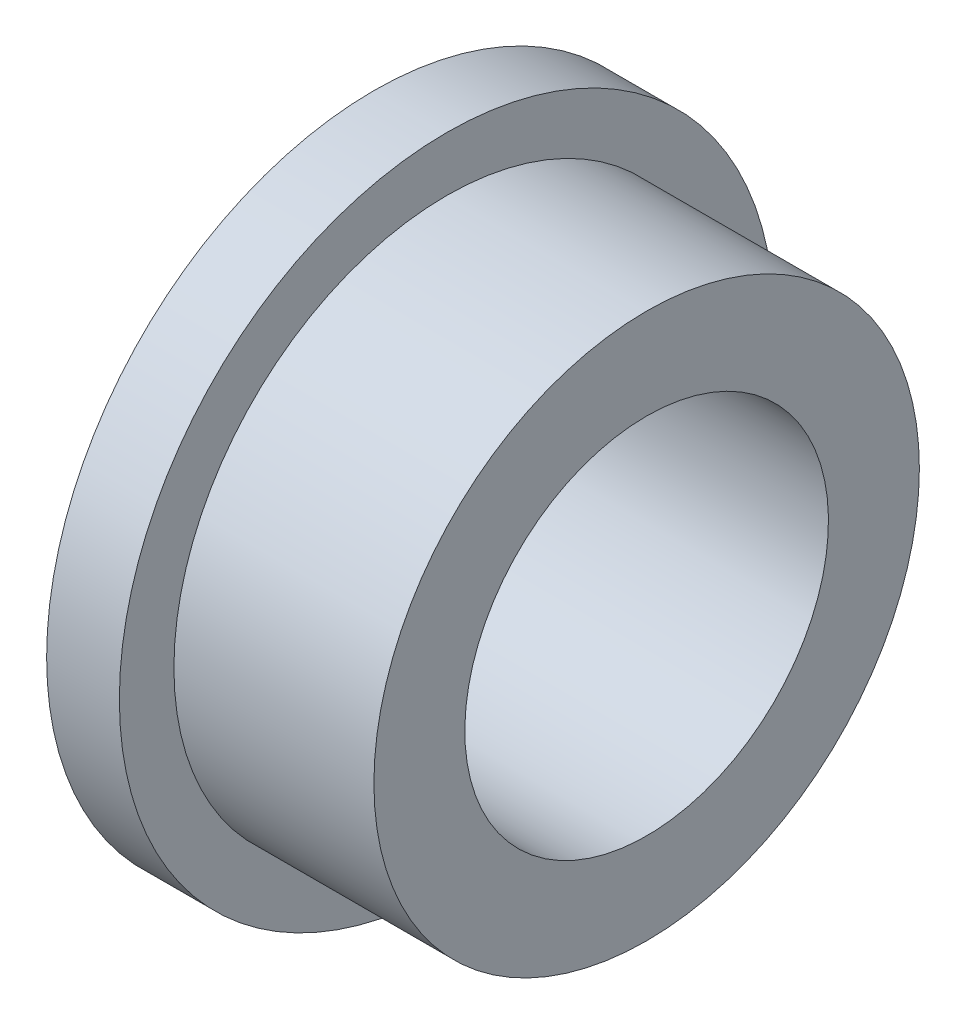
ISO-10303-21;
HEADER;
FILE_DESCRIPTION(('STEP AP214'),'2;1');
FILE_NAME('part.step','',(''),(''),'','','');
FILE_SCHEMA(('AUTOMOTIVE_DESIGN { 1 0 10303 214 1 1 1 1 }'));
ENDSEC;
DATA;
#1=APPLICATION_CONTEXT('core data for automotive mechanical design processes');
#2=APPLICATION_PROTOCOL_DEFINITION('international standard','automotive_design',2000,#1);
#3=PRODUCT_CONTEXT('',#1,'mechanical');
#4=PRODUCT('Part','Part','',(#3));
#5=PRODUCT_RELATED_PRODUCT_CATEGORY('part','',(#4));
#6=PRODUCT_DEFINITION_FORMATION('','',#4);
#7=PRODUCT_DEFINITION_CONTEXT('part definition',#1,'design');
#8=PRODUCT_DEFINITION('design','',#6,#7);
#9=PRODUCT_DEFINITION_SHAPE('','',#8);
#10=(LENGTH_UNIT() NAMED_UNIT(*) SI_UNIT(.MILLI.,.METRE.));
#11=(NAMED_UNIT(*) PLANE_ANGLE_UNIT() SI_UNIT($,.RADIAN.));
#12=(NAMED_UNIT(*) SI_UNIT($,.STERADIAN.) SOLID_ANGLE_UNIT());
#13=UNCERTAINTY_MEASURE_WITH_UNIT(LENGTH_MEASURE(1.E-05),#10,'distance_accuracy_value','');
#14=(GEOMETRIC_REPRESENTATION_CONTEXT(3) GLOBAL_UNCERTAINTY_ASSIGNED_CONTEXT((#13)) GLOBAL_UNIT_ASSIGNED_CONTEXT((#10,
#11,#12)) REPRESENTATION_CONTEXT('',''));
#15=CARTESIAN_POINT('',(0.,0.,0.));
#16=DIRECTION('',(0.,0.,1.));
#17=DIRECTION('',(1.,0.,0.));
#18=AXIS2_PLACEMENT_3D('',#15,#16,#17);
#19=CARTESIAN_POINT('',(0.,5.,0.));
#20=DIRECTION('',(1.,0.,0.));
#21=DIRECTION('',(0.,1.,0.));
#22=AXIS2_PLACEMENT_3D('',#19,#20,#21);
#23=PLANE('',#22);
#24=CARTESIAN_POINT('',(0.,0.,0.));
#25=DIRECTION('',(1.,0.,0.));
#26=DIRECTION('',(0.,1.,0.));
#27=AXIS2_PLACEMENT_3D('',#24,#25,#26);
#28=CIRCLE('',#27,7.5);
#29=CARTESIAN_POINT('',(0.,7.5,0.));
#30=VERTEX_POINT('',#29);
#31=EDGE_CURVE('E10',#30,#30,#28,.T.);
#32=ORIENTED_EDGE('',*,*,#31,.T.);
#33=EDGE_LOOP('',(#32));
#34=FACE_BOUND('',#33,.T.);
#35=CARTESIAN_POINT('',(0.,0.,0.));
#36=DIRECTION('',(1.,0.,0.));
#37=DIRECTION('',(0.,1.,0.));
#38=AXIS2_PLACEMENT_3D('',#35,#36,#37);
#39=CIRCLE('',#38,5.);
#40=CARTESIAN_POINT('',(0.,5.,0.));
#41=VERTEX_POINT('',#40);
#42=EDGE_CURVE('E370',#41,#41,#39,.T.);
#43=ORIENTED_EDGE('',*,*,#42,.F.);
#44=EDGE_LOOP('',(#43));
#45=FACE_BOUND('',#44,.T.);
#46=ADVANCED_FACE('F348',(#34,#45),#23,.T.);
#47=CARTESIAN_POINT('',(0.,0.,0.));
#48=DIRECTION('',(1.,0.,0.));
#49=DIRECTION('',(0.,1.,0.));
#50=AXIS2_PLACEMENT_3D('',#47,#48,#49);
#51=CYLINDRICAL_SURFACE('',#50,7.5);
#52=CARTESIAN_POINT('',(-5.5,0.,0.));
#53=DIRECTION('',(1.,0.,0.));
#54=DIRECTION('',(0.,1.,0.));
#55=AXIS2_PLACEMENT_3D('',#52,#53,#54);
#56=CIRCLE('',#55,7.5);
#57=CARTESIAN_POINT('',(-5.5,7.5,0.));
#58=VERTEX_POINT('',#57);
#59=EDGE_CURVE('E354',#58,#58,#56,.T.);
#60=ORIENTED_EDGE('',*,*,#59,.T.);
#61=EDGE_LOOP('',(#60));
#62=FACE_BOUND('',#61,.T.);
#63=ORIENTED_EDGE('',*,*,#31,.F.);
#64=EDGE_LOOP('',(#63));
#65=FACE_BOUND('',#64,.T.);
#66=ADVANCED_FACE('F378',(#62,#65),#51,.T.);
#67=CARTESIAN_POINT('',(-5.5,7.5,0.));
#68=DIRECTION('',(1.,0.,0.));
#69=DIRECTION('',(0.,1.,0.));
#70=AXIS2_PLACEMENT_3D('',#67,#68,#69);
#71=PLANE('',#70);
#72=CARTESIAN_POINT('',(-5.5,0.,0.));
#73=DIRECTION('',(1.,0.,0.));
#74=DIRECTION('',(0.,1.,0.));
#75=AXIS2_PLACEMENT_3D('',#72,#73,#74);
#76=CIRCLE('',#75,9.);
#77=CARTESIAN_POINT('',(-5.5,9.,0.));
#78=VERTEX_POINT('',#77);
#79=EDGE_CURVE('E358',#78,#78,#76,.T.);
#80=ORIENTED_EDGE('',*,*,#79,.T.);
#81=EDGE_LOOP('',(#80));
#82=FACE_BOUND('',#81,.T.);
#83=ORIENTED_EDGE('',*,*,#59,.F.);
#84=EDGE_LOOP('',(#83));
#85=FACE_BOUND('',#84,.T.);
#86=ADVANCED_FACE('F382',(#82,#85),#71,.T.);
#87=CARTESIAN_POINT('',(0.,0.,0.));
#88=DIRECTION('',(1.,0.,0.));
#89=DIRECTION('',(0.,1.,0.));
#90=AXIS2_PLACEMENT_3D('',#87,#88,#89);
#91=CYLINDRICAL_SURFACE('',#90,9.);
#92=CARTESIAN_POINT('',(-7.5,0.,0.));
#93=DIRECTION('',(1.,0.,0.));
#94=DIRECTION('',(0.,1.,0.));
#95=AXIS2_PLACEMENT_3D('',#92,#93,#94);
#96=CIRCLE('',#95,9.);
#97=CARTESIAN_POINT('',(-7.5,9.,0.));
#98=VERTEX_POINT('',#97);
#99=EDGE_CURVE('E362',#98,#98,#96,.T.);
#100=ORIENTED_EDGE('',*,*,#99,.T.);
#101=EDGE_LOOP('',(#100));
#102=FACE_BOUND('',#101,.T.);
#103=ORIENTED_EDGE('',*,*,#79,.F.);
#104=EDGE_LOOP('',(#103));
#105=FACE_BOUND('',#104,.T.);
#106=ADVANCED_FACE('F386',(#102,#105),#91,.T.);
#107=CARTESIAN_POINT('',(-7.5,9.,0.));
#108=DIRECTION('',(-1.,0.,0.));
#109=DIRECTION('',(0.,-1.,0.));
#110=AXIS2_PLACEMENT_3D('',#107,#108,#109);
#111=PLANE('',#110);
#112=CARTESIAN_POINT('',(-7.5,0.,0.));
#113=DIRECTION('',(1.,0.,0.));
#114=DIRECTION('',(0.,1.,0.));
#115=AXIS2_PLACEMENT_3D('',#112,#113,#114);
#116=CIRCLE('',#115,5.);
#117=CARTESIAN_POINT('',(-7.5,5.,0.));
#118=VERTEX_POINT('',#117);
#119=EDGE_CURVE('E367',#118,#118,#116,.T.);
#120=ORIENTED_EDGE('',*,*,#119,.T.);
#121=EDGE_LOOP('',(#120));
#122=FACE_BOUND('',#121,.T.);
#123=ORIENTED_EDGE('',*,*,#99,.F.);
#124=EDGE_LOOP('',(#123));
#125=FACE_BOUND('',#124,.T.);
#126=ADVANCED_FACE('F393',(#122,#125),#111,.T.);
#127=CARTESIAN_POINT('',(0.,0.,0.));
#128=DIRECTION('',(1.,0.,0.));
#129=DIRECTION('',(0.,1.,0.));
#130=AXIS2_PLACEMENT_3D('',#127,#128,#129);
#131=CYLINDRICAL_SURFACE('',#130,5.);
#132=ORIENTED_EDGE('',*,*,#42,.T.);
#133=EDGE_LOOP('',(#132));
#134=FACE_BOUND('',#133,.T.);
#135=ORIENTED_EDGE('',*,*,#119,.F.);
#136=EDGE_LOOP('',(#135));
#137=FACE_BOUND('',#136,.T.);
#138=ADVANCED_FACE('F374',(#134,#137),#131,.F.);
#139=CLOSED_SHELL('',(#46,#66,#86,#106,#126,#138));
#140=MANIFOLD_SOLID_BREP('B2',#139);
#141=ADVANCED_BREP_SHAPE_REPRESENTATION('',(#18,#140),#14);
#142=SHAPE_DEFINITION_REPRESENTATION(#9,#141);
ENDSEC;
END-ISO-10303-21;
